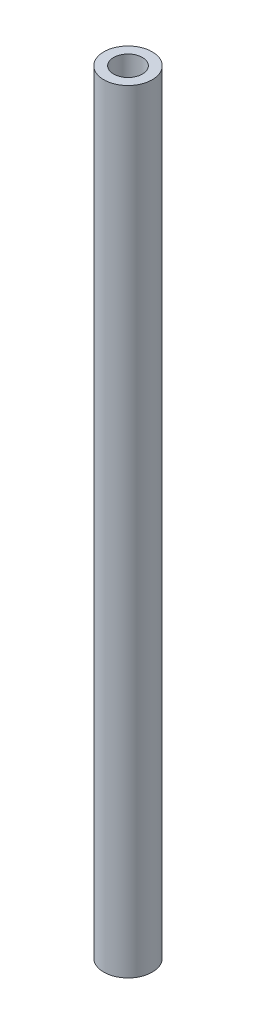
ISO-10303-21;
HEADER;
FILE_DESCRIPTION(('STEP AP214'),'2;1');
FILE_NAME('part.step','',(''),(''),'','','');
FILE_SCHEMA(('AUTOMOTIVE_DESIGN { 1 0 10303 214 1 1 1 1 }'));
ENDSEC;
DATA;
#1=APPLICATION_CONTEXT('core data for automotive mechanical design processes');
#2=APPLICATION_PROTOCOL_DEFINITION('international standard','automotive_design',2000,#1);
#3=PRODUCT_CONTEXT('',#1,'mechanical');
#4=PRODUCT('Part','Part','',(#3));
#5=PRODUCT_RELATED_PRODUCT_CATEGORY('part','',(#4));
#6=PRODUCT_DEFINITION_FORMATION('','',#4);
#7=PRODUCT_DEFINITION_CONTEXT('part definition',#1,'design');
#8=PRODUCT_DEFINITION('design','',#6,#7);
#9=PRODUCT_DEFINITION_SHAPE('','',#8);
#10=(LENGTH_UNIT() NAMED_UNIT(*) SI_UNIT(.MILLI.,.METRE.));
#11=(NAMED_UNIT(*) PLANE_ANGLE_UNIT() SI_UNIT($,.RADIAN.));
#12=(NAMED_UNIT(*) SI_UNIT($,.STERADIAN.) SOLID_ANGLE_UNIT());
#13=UNCERTAINTY_MEASURE_WITH_UNIT(LENGTH_MEASURE(1.E-05),#10,'distance_accuracy_value','');
#14=(GEOMETRIC_REPRESENTATION_CONTEXT(3) GLOBAL_UNCERTAINTY_ASSIGNED_CONTEXT((#13)) GLOBAL_UNIT_ASSIGNED_CONTEXT((#10,
#11,#12)) REPRESENTATION_CONTEXT('',''));
#15=CARTESIAN_POINT('',(0.,0.,0.));
#16=DIRECTION('',(0.,0.,1.));
#17=DIRECTION('',(1.,0.,0.));
#18=AXIS2_PLACEMENT_3D('',#15,#16,#17);
#19=CARTESIAN_POINT('',(0.,76.2,0.));
#20=DIRECTION('',(0.,-1.,0.));
#21=DIRECTION('',(0.,0.,-1.));
#22=AXIS2_PLACEMENT_3D('',#19,#20,#21);
#23=CYLINDRICAL_SURFACE('',#22,2.3876);
#24=CARTESIAN_POINT('',(0.,76.2,0.));
#25=DIRECTION('',(0.,1.,0.));
#26=DIRECTION('',(0.,0.,1.));
#27=AXIS2_PLACEMENT_3D('',#24,#25,#26);
#28=CIRCLE('',#27,2.3876);
#29=CARTESIAN_POINT('',(0.,76.2,-2.3876));
#30=VERTEX_POINT('',#29);
#31=EDGE_CURVE('E11',#30,#30,#28,.T.);
#32=CARTESIAN_POINT('',(0.,0.,0.));
#33=DIRECTION('',(0.,1.,0.));
#34=DIRECTION('',(0.,0.,1.));
#35=AXIS2_PLACEMENT_3D('',#32,#33,#34);
#36=CIRCLE('',#35,2.3876);
#37=CARTESIAN_POINT('',(0.,0.,-2.3876));
#38=VERTEX_POINT('',#37);
#39=EDGE_CURVE('E36',#38,#38,#36,.T.);
#40=CARTESIAN_POINT('',(0.,76.2,-2.3876));
#41=CARTESIAN_POINT('',(0.,75.40625,-2.3876));
#42=CARTESIAN_POINT('',(0.,74.6125,-2.3876));
#43=CARTESIAN_POINT('',(0.,73.025,-2.3876));
#44=CARTESIAN_POINT('',(0.,72.23125,-2.3876));
#45=CARTESIAN_POINT('',(0.,70.64375,-2.3876));
#46=CARTESIAN_POINT('',(0.,69.85,-2.3876));
#47=CARTESIAN_POINT('',(0.,68.2625,-2.3876));
#48=CARTESIAN_POINT('',(0.,67.46875,-2.3876));
#49=CARTESIAN_POINT('',(0.,65.88125,-2.3876));
#50=CARTESIAN_POINT('',(0.,65.0875,-2.3876));
#51=CARTESIAN_POINT('',(0.,63.5,-2.3876));
#52=CARTESIAN_POINT('',(0.,62.70625,-2.3876));
#53=CARTESIAN_POINT('',(0.,61.11875,-2.3876));
#54=CARTESIAN_POINT('',(0.,60.325,-2.3876));
#55=CARTESIAN_POINT('',(0.,58.7375,-2.3876));
#56=CARTESIAN_POINT('',(0.,57.94375,-2.3876));
#57=CARTESIAN_POINT('',(0.,56.35625,-2.3876));
#58=CARTESIAN_POINT('',(0.,55.5625,-2.3876));
#59=CARTESIAN_POINT('',(0.,53.975,-2.3876));
#60=CARTESIAN_POINT('',(0.,53.18125,-2.3876));
#61=CARTESIAN_POINT('',(0.,51.59375,-2.3876));
#62=CARTESIAN_POINT('',(0.,50.8,-2.3876));
#63=CARTESIAN_POINT('',(0.,49.2125,-2.3876));
#64=CARTESIAN_POINT('',(0.,48.41875,-2.3876));
#65=CARTESIAN_POINT('',(0.,46.83125,-2.3876));
#66=CARTESIAN_POINT('',(0.,46.0375,-2.3876));
#67=CARTESIAN_POINT('',(0.,44.45,-2.3876));
#68=CARTESIAN_POINT('',(0.,43.65625,-2.3876));
#69=CARTESIAN_POINT('',(0.,42.06875,-2.3876));
#70=CARTESIAN_POINT('',(0.,41.275,-2.3876));
#71=CARTESIAN_POINT('',(0.,39.6875,-2.3876));
#72=CARTESIAN_POINT('',(0.,38.89375,-2.3876));
#73=CARTESIAN_POINT('',(0.,37.30625,-2.3876));
#74=CARTESIAN_POINT('',(0.,36.5125,-2.3876));
#75=CARTESIAN_POINT('',(0.,34.925,-2.3876));
#76=CARTESIAN_POINT('',(0.,34.13125,-2.3876));
#77=CARTESIAN_POINT('',(0.,32.54375,-2.3876));
#78=CARTESIAN_POINT('',(0.,31.75,-2.3876));
#79=CARTESIAN_POINT('',(0.,30.1625,-2.3876));
#80=CARTESIAN_POINT('',(0.,29.36875,-2.3876));
#81=CARTESIAN_POINT('',(0.,27.78125,-2.3876));
#82=CARTESIAN_POINT('',(0.,26.9875,-2.3876));
#83=CARTESIAN_POINT('',(0.,25.4,-2.3876));
#84=CARTESIAN_POINT('',(0.,24.60625,-2.3876));
#85=CARTESIAN_POINT('',(0.,23.01875,-2.3876));
#86=CARTESIAN_POINT('',(0.,22.225,-2.3876));
#87=CARTESIAN_POINT('',(0.,20.6375,-2.3876));
#88=CARTESIAN_POINT('',(0.,19.84375,-2.3876));
#89=CARTESIAN_POINT('',(0.,18.25625,-2.3876));
#90=CARTESIAN_POINT('',(0.,17.4625,-2.3876));
#91=CARTESIAN_POINT('',(0.,15.875,-2.3876));
#92=CARTESIAN_POINT('',(0.,15.08125,-2.3876));
#93=CARTESIAN_POINT('',(0.,13.49375,-2.3876));
#94=CARTESIAN_POINT('',(0.,12.7,-2.3876));
#95=CARTESIAN_POINT('',(0.,11.1125,-2.3876));
#96=CARTESIAN_POINT('',(0.,10.31875,-2.3876));
#97=CARTESIAN_POINT('',(0.,8.73125,-2.3876));
#98=CARTESIAN_POINT('',(0.,7.93750000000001,-2.3876));
#99=CARTESIAN_POINT('',(0.,6.35,-2.3876));
#100=CARTESIAN_POINT('',(0.,5.55625,-2.3876));
#101=CARTESIAN_POINT('',(0.,3.96875,-2.3876));
#102=CARTESIAN_POINT('',(0.,3.175,-2.3876));
#103=CARTESIAN_POINT('',(0.,1.5875,-2.3876));
#104=CARTESIAN_POINT('',(0.,0.793750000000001,-2.3876));
#105=CARTESIAN_POINT('',(0.,0.,-2.3876));
#106=B_SPLINE_CURVE_WITH_KNOTS('',3,(#40,#41,#42,#43,#44,#45,#46,#47,#48,#49,#50,#51,#52,#53,
#54,#55,#56,#57,#58,#59,#60,#61,#62,#63,#64,#65,#66,#67,#68,#69,#70,#71,#72,#73,#74,#75,#76,#77,
#78,#79,#80,#81,#82,#83,#84,#85,#86,#87,#88,#89,#90,#91,#92,#93,#94,#95,#96,#97,#98,#99,#100,
#101,#102,#103,#104,#105),.UNSPECIFIED.,.F.,.F.,(4,2,2,2,2,2,2,2,2,2,2,2,2,2,2,2,2,2,2,2,2,2,2,
2,2,2,2,2,2,2,2,2,4),(0.,2.38125,4.7625,7.14375,9.52500000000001,11.90625,14.2875,16.66875,
19.05,21.43125,23.8125,26.19375,28.575,30.95625,33.3375,35.71875,38.1,40.48125,42.8625,45.24375,
47.625,50.00625,52.3875,54.76875,57.15,59.53125,61.9125,64.29375,66.675,69.05625,71.4375,
73.81875,76.2),.UNSPECIFIED.);
#107=EDGE_CURVE('BSEAM30',#30,#38,#106,.T.);
#108=ORIENTED_EDGE('',*,*,#31,.F.);
#109=ORIENTED_EDGE('',*,*,#39,.T.);
#110=ORIENTED_EDGE('',*,*,#107,.T.);
#111=ORIENTED_EDGE('',*,*,#107,.F.);
#112=EDGE_LOOP('',(#108,#110,#109,#111));
#113=FACE_BOUND('',#112,.T.);
#114=ADVANCED_FACE('F30',(#113),#23,.T.);
#115=CARTESIAN_POINT('',(0.,76.2,0.));
#116=DIRECTION('',(0.,1.,0.));
#117=DIRECTION('',(0.,0.,1.));
#118=AXIS2_PLACEMENT_3D('',#115,#116,#117);
#119=PLANE('',#118);
#120=CARTESIAN_POINT('',(0.,76.2,0.));
#121=DIRECTION('',(0.,1.,0.));
#122=DIRECTION('',(0.,0.,1.));
#123=AXIS2_PLACEMENT_3D('',#120,#121,#122);
#124=CIRCLE('',#123,1.42239999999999);
#125=CARTESIAN_POINT('',(0.,76.2,1.42239999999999));
#126=VERTEX_POINT('',#125);
#127=EDGE_CURVE('E56',#126,#126,#124,.T.);
#128=ORIENTED_EDGE('',*,*,#127,.F.);
#129=EDGE_LOOP('',(#128));
#130=FACE_BOUND('',#129,.T.);
#131=ORIENTED_EDGE('',*,*,#31,.T.);
#132=EDGE_LOOP('',(#131));
#133=FACE_BOUND('',#132,.T.);
#134=ADVANCED_FACE('F65',(#130,#133),#119,.T.);
#135=CARTESIAN_POINT('',(0.,0.,0.));
#136=DIRECTION('',(0.,1.,0.));
#137=DIRECTION('',(0.,0.,1.));
#138=AXIS2_PLACEMENT_3D('',#135,#136,#137);
#139=PLANE('',#138);
#140=ORIENTED_EDGE('',*,*,#39,.F.);
#141=EDGE_LOOP('',(#140));
#142=FACE_BOUND('',#141,.T.);
#143=ADVANCED_FACE('F62',(#142),#139,.F.);
#144=CARTESIAN_POINT('',(0.,76.2,0.));
#145=DIRECTION('',(0.,1.,0.));
#146=DIRECTION('',(0.,0.,1.));
#147=AXIS2_PLACEMENT_3D('',#144,#145,#146);
#148=CYLINDRICAL_SURFACE('',#147,1.42239999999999);
#149=CARTESIAN_POINT('',(0.,66.548,0.));
#150=DIRECTION('',(0.,1.,0.));
#151=DIRECTION('',(0.,0.,1.));
#152=AXIS2_PLACEMENT_3D('',#149,#150,#151);
#153=CIRCLE('',#152,1.42239999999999);
#154=CARTESIAN_POINT('',(0.,66.548,1.42239999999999));
#155=VERTEX_POINT('',#154);
#156=EDGE_CURVE('E51',#155,#155,#153,.T.);
#157=ORIENTED_EDGE('',*,*,#156,.F.);
#158=EDGE_LOOP('',(#157));
#159=FACE_BOUND('',#158,.T.);
#160=ORIENTED_EDGE('',*,*,#127,.T.);
#161=EDGE_LOOP('',(#160));
#162=FACE_BOUND('',#161,.T.);
#163=ADVANCED_FACE('F64',(#159,#162),#148,.F.);
#164=CARTESIAN_POINT('',(1.1303,66.548,0.));
#165=DIRECTION('',(0.,-1.,0.));
#166=DIRECTION('',(0.,0.,-1.));
#167=AXIS2_PLACEMENT_3D('',#164,#165,#166);
#168=PLANE('',#167);
#169=CARTESIAN_POINT('',(0.,66.548,0.));
#170=DIRECTION('',(0.,1.,0.));
#171=DIRECTION('',(0.,0.,1.));
#172=AXIS2_PLACEMENT_3D('',#169,#170,#171);
#173=CIRCLE('',#172,1.1303);
#174=CARTESIAN_POINT('',(0.,66.548,1.1303));
#175=VERTEX_POINT('',#174);
#176=EDGE_CURVE('E48',#175,#175,#173,.T.);
#177=ORIENTED_EDGE('',*,*,#176,.F.);
#178=EDGE_LOOP('',(#177));
#179=FACE_BOUND('',#178,.T.);
#180=ORIENTED_EDGE('',*,*,#156,.T.);
#181=EDGE_LOOP('',(#180));
#182=FACE_BOUND('',#181,.T.);
#183=ADVANCED_FACE('F71',(#179,#182),#168,.F.);
#184=CARTESIAN_POINT('',(0.,76.2,0.));
#185=DIRECTION('',(0.,1.,0.));
#186=DIRECTION('',(0.,0.,1.));
#187=AXIS2_PLACEMENT_3D('',#184,#185,#186);
#188=CYLINDRICAL_SURFACE('',#187,1.1303);
#189=CARTESIAN_POINT('',(0.,63.246,0.));
#190=DIRECTION('',(0.,1.,0.));
#191=DIRECTION('',(0.,0.,1.));
#192=AXIS2_PLACEMENT_3D('',#189,#190,#191);
#193=CIRCLE('',#192,1.1303);
#194=CARTESIAN_POINT('',(0.,63.246,1.1303));
#195=VERTEX_POINT('',#194);
#196=EDGE_CURVE('E46',#195,#195,#193,.T.);
#197=ORIENTED_EDGE('',*,*,#196,.F.);
#198=EDGE_LOOP('',(#197));
#199=FACE_BOUND('',#198,.T.);
#200=ORIENTED_EDGE('',*,*,#176,.T.);
#201=EDGE_LOOP('',(#200));
#202=FACE_BOUND('',#201,.T.);
#203=ADVANCED_FACE('F42',(#199,#202),#188,.F.);
#204=CARTESIAN_POINT('',(0.,63.246,0.));
#205=DIRECTION('',(0.,1.,0.));
#206=DIRECTION('',(0.,0.,1.));
#207=AXIS2_PLACEMENT_3D('',#204,#205,#206);
#208=CONICAL_SURFACE('',#207,1.1303,1.02974425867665);
#209=CARTESIAN_POINT('',(0.,62.5668472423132,0.));
#210=VERTEX_POINT('',#209);
#211=VERTEX_LOOP('',#210);
#212=FACE_BOUND('',#211,.T.);
#213=ORIENTED_EDGE('',*,*,#196,.T.);
#214=EDGE_LOOP('',(#213));
#215=FACE_BOUND('',#214,.T.);
#216=ADVANCED_FACE('F39',(#212,#215),#208,.F.);
#217=CLOSED_SHELL('',(#114,#134,#143,#163,#183,#203,#216));
#218=MANIFOLD_SOLID_BREP('B2',#217);
#219=ADVANCED_BREP_SHAPE_REPRESENTATION('',(#18,#218),#14);
#220=SHAPE_DEFINITION_REPRESENTATION(#9,#219);
ENDSEC;
END-ISO-10303-21;
